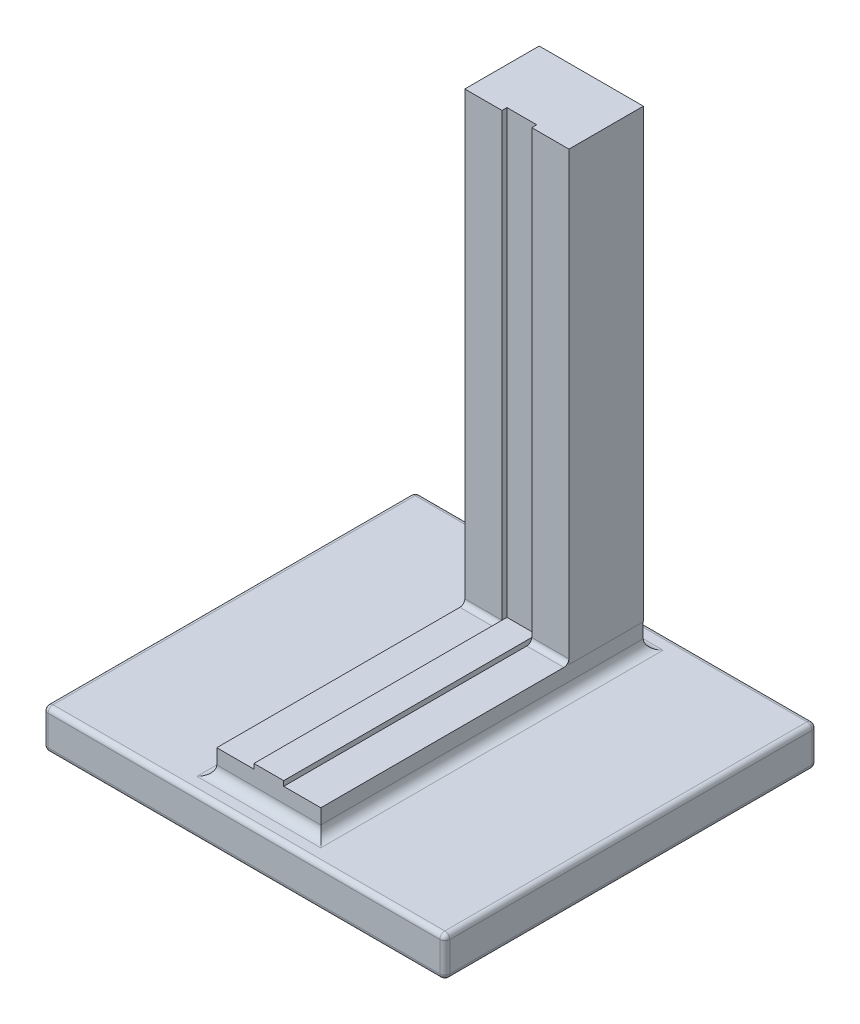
from build123d import *

# Parameters (mm, degrees)
ESQUISSE1_W             = 420
ESQUISSE1_H             = 1800
EXTRUSION1_DEPTH        = 300
ESQUISSE2_W             = 120
ESQUISSE2_H             = 1800
ENL_V_MAT_EXTRU_1_DEPTH = 20
EXTRUSION2_DEPTH        = 1000
EXTRUSION2_DEPTH_BACK   = 300
ESQUISSE3_W             = 419.479929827
ESQUISSE3_H             = 100
ESQUISSE4_W             = 120
ESQUISSE4_H             = 20
EXTRUSION3_DEPTH        = 1050
ESQUISSE5_W             = 1619.479929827
ESQUISSE5_H             = 1500
EXTRUSION4_DEPTH        = 160
CONG_4_R                = 40
CONG_5_R                = 20
CONG_6_R                = 20


with BuildPart() as part:
    # Esquisse1 → Extrusion1 (new body)
    with BuildSketch(Plane.XY):
        with Locations((210, 900)):
            Rectangle(ESQUISSE1_W, ESQUISSE1_H)
    extrude(amount=EXTRUSION1_DEPTH)

    # Esquisse2 → Enl_v. mat.-Extru.1 (cut)
    with BuildSketch(Plane.XY.offset(300)):
        with Locations((210, 900)):
            Rectangle(ESQUISSE2_W, ESQUISSE2_H)
    extrude(amount=-ENL_V_MAT_EXTRU_1_DEPTH, mode=Mode.SUBTRACT)

    # Esquisse3 → Extrusion2 (add, two sides: drawn at the far end of the back side and taken through both)
    with BuildSketch(Plane.XY.offset(300).offset(-EXTRUSION2_DEPTH_BACK)):
        with Locations((209.739964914, -50)):
            Rectangle(ESQUISSE3_W, ESQUISSE3_H)
    extrude(amount=EXTRUSION2_DEPTH + EXTRUSION2_DEPTH_BACK)

    # Esquisse4 → Extrusion3 (add)
    with BuildSketch(Plane.XY.offset(1300)):
        with Locations((210, 10)):
            Rectangle(ESQUISSE4_W, ESQUISSE4_H)
    extrude(amount=-EXTRUSION3_DEPTH)

    # Esquisse5 → Extrusion4 (add)
    with BuildSketch(Plane.XZ.offset(100)):
        with Locations((209.739964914, 650)):
            Rectangle(ESQUISSE5_W, ESQUISSE5_H)
    extrude(amount=EXTRUSION4_DEPTH)

    # Cong_4
    cong_4_edges = [part.edges().sort_by_distance(p)[0] for p in [
        (0, -100, 650),
        (209.739964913, -100, 0),
        (419.479929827, -100, 650),
        (209.739964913, -100, 1300),
    ]]
    fillet(cong_4_edges, radius=CONG_4_R)

    # Cong_5
    cong_5_edges = [part.edges().sort_by_distance(p)[0] for p in [
        (344.739964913, 0, 300),
        (75, 0, 300),
    ]]
    fillet(cong_5_edges, radius=CONG_5_R)

    # Cong_6
    cong_6_edges = [part.edges().sort_by_distance(p)[0] for p in [
        (-600, -100, 650),
        (-600, -180, 1400),
        (209.739964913, -100, -100),
        (-600, -180, -100),
        (1019.479929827, -100, 650),
        (1019.479929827, -180, -100),
        (209.739964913, -100, 1400),
        (1019.479929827, -180, 1400),
        (-600, -260, 650),
        (209.739964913, -260, -100),
        (1019.479929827, -260, 650),
        (209.739964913, -260, 1400),
    ]]
    fillet(cong_6_edges, radius=CONG_6_R)


solid = part.part
